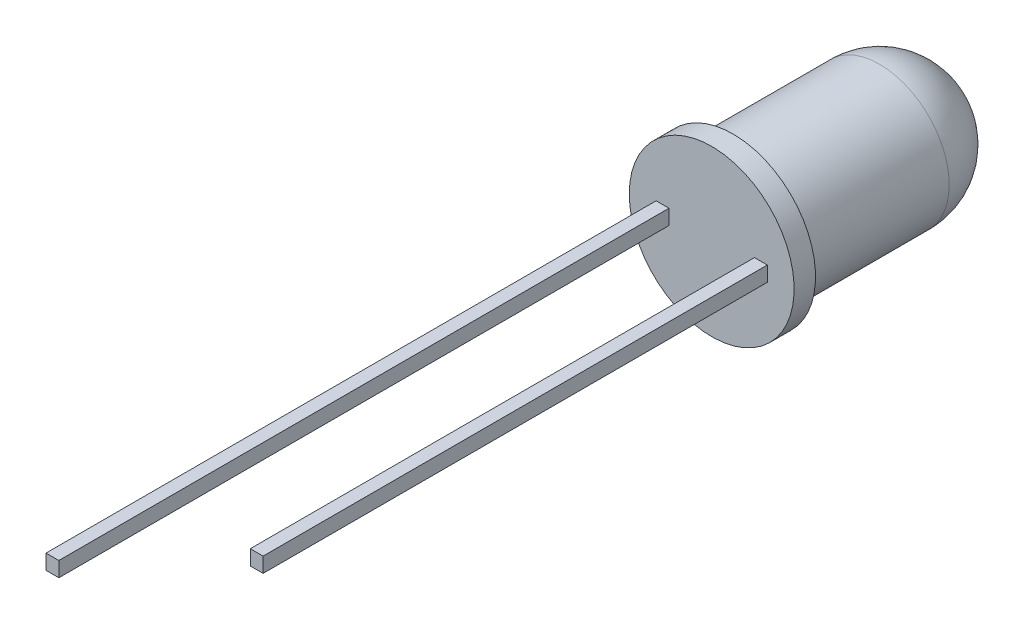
from build123d import *

# Parameters (mm, degrees)
BOSS_EXTRUDE1_DEPTH = 0.35
BOSS_EXTRUDE2_DEPTH = 0.35


with BuildPart() as part:
    # Sketch1 → Boss-Extrude1 (new, symmetric)
    with BuildSketch(Plane(origin=(0, 0, 0), x_dir=(1, 0, 0), z_dir=(0, 1, 0))):
        Polygon((-0.6, 0), (-0.6, 30), (-0.921269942, 30), (-0.921269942, 32), (-0.364499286, 32), (-0.364499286, 31.863365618), (1.498866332, 30), (0, 30), (0, 0), align=None)
    extrude(amount=BOSS_EXTRUDE1_DEPTH, both=True)


with BuildPart() as body_2:
    # Sketch2 → Boss-Extrude2 (new, symmetric)
    with BuildSketch(Plane(origin=(0, 0, 0), x_dir=(1, 0, 0), z_dir=(0, 1, 0))):
        Polygon((0.263788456, 32), (0.263788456, 31.863365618), (2.127154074, 30), (3.993555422, 30), (3.993555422, 4.948502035), (4.593555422, 4.948502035), (4.593555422, 32), align=None)
    extrude(amount=BOSS_EXTRUDE2_DEPTH, both=True)


with BuildPart() as body_3:
    # Sketch3 → Revolve1 (revolve)
    with BuildSketch(Plane(origin=(0, 0, 0), x_dir=(1, 0, 0), z_dir=(0, 1, 0)), mode=Mode.PRIVATE) as revolve1_sk:
        with BuildLine():
            Line((1.995, 28.5), (5.845, 28.5))
            Line((5.845, 28.5), (5.845, 29.5))
            Line((5.845, 29.5), (5.245, 29.5))
            Line((5.245, 29.5), (5.245, 36.344198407))
            ThreePointArc((5.245, 36.344198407), (4.293097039, 38.642295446), (1.995, 39.594198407))
            Line((1.995, 39.594198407), (1.995, 28.5))
        make_face()
    revolve(revolve1_sk.sketch.rotate(Axis((1.995, 0, -38.642405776), (0, 0, 1)), 180), axis=Axis((1.995, 0, -38.642405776), (0, 0, 1)))


solid = Compound([part.part, body_2.part, body_3.part])
